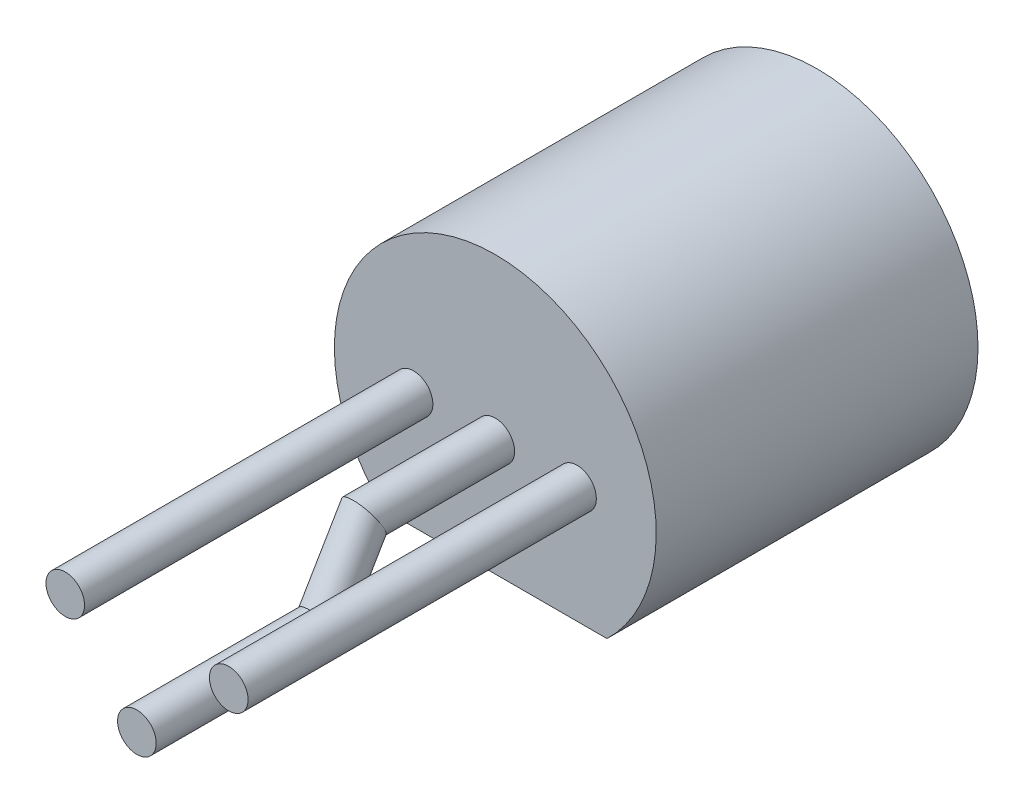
from build123d import *

# Parameters (mm, degrees)
BASE_EXTRUSION_DEPTH = 5
ESQUISSE2_R          = 0.3
ESQUISSE4_R          = 0.3


with BuildPart() as part:
    # Esquisse1 → Base-Extrusion (new body)
    with BuildSketch(Plane.XY):
        with BuildLine():
            Line((-1.734935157, -1.8), (1.734935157, -1.8))
            ThreePointArc((1.734935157, -1.8), (0, 2.5), (-1.734935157, -1.8))
        make_face()
    extrude(amount=BASE_EXTRUSION_DEPTH)

    # Boss.-Balayage1: sweep along a path in Esquisse3
    with BuildLine(Plane(origin=(0, 0, 0), x_dir=(1, 0, 0), z_dir=(0, 1, 0))) as boss_balayage1_path:
        Line((-1.27, -5), (-1.27, -10.411423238))
    # Esquisse2 → Boss.-Balayage1 (sweep)
    with BuildSketch(Plane.XY.offset(5)):
        with Locations((-1.27, 0)):
            Circle(ESQUISSE2_R)
    boss_balayage1 = sweep(path=boss_balayage1_path.line)

    # Sym_trie1: Boss.-Balayage1 across plane
    add(boss_balayage1.mirror(Plane(origin=(0, 0, 0), x_dir=(0, 0, 1), z_dir=(1, 0, 0))))

    # Balayage1: sweep along a path in Esquisse6
    with BuildLine(Plane(origin=(0, 0, 0), x_dir=(0, 0, -1), z_dir=(1, 0, 0))) as balayage1_path:
        Line((-5, 0), (-7.039478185, 0))
        Line((-7.039478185, 0), (-7.711287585, -1.142447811))
        Line((-7.711287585, -1.142447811), (-10.568962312, -1.142447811))
    # Esquisse4 → Balayage1 (sweep)
    with BuildSketch(Plane.XY.offset(5)):
        Circle(ESQUISSE4_R)
    sweep(path=balayage1_path.line, transition=Transition.RIGHT)


solid = part.part
